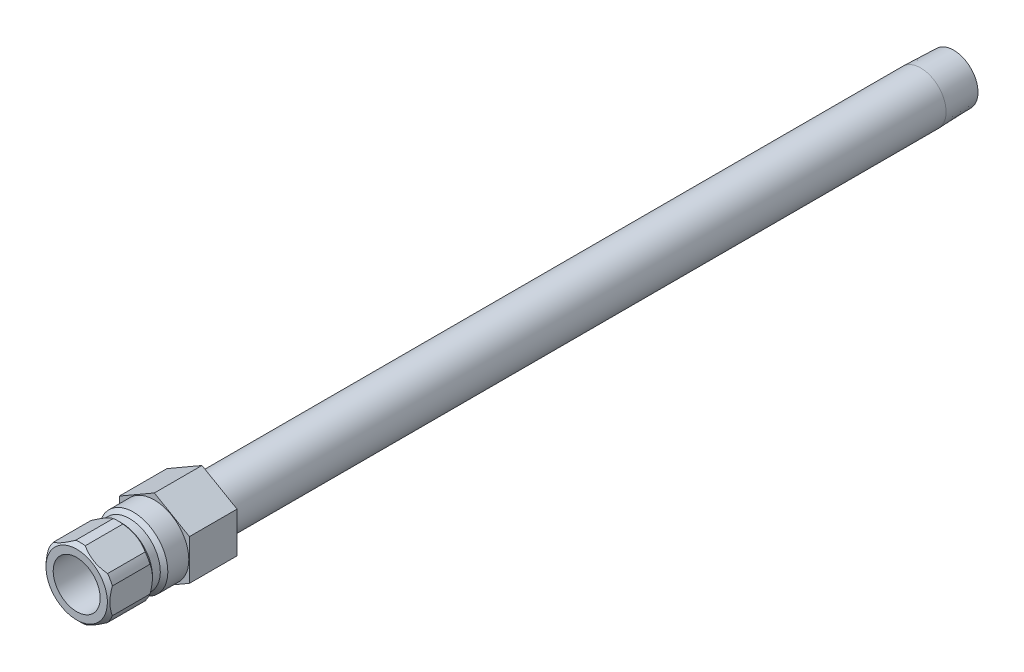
ISO-10303-21;
HEADER;
FILE_DESCRIPTION(('STEP AP214'),'2;1');
FILE_NAME('part.step','',(''),(''),'','','');
FILE_SCHEMA(('AUTOMOTIVE_DESIGN { 1 0 10303 214 1 1 1 1 }'));
ENDSEC;
DATA;
#1=APPLICATION_CONTEXT('core data for automotive mechanical design processes');
#2=APPLICATION_PROTOCOL_DEFINITION('international standard','automotive_design',2000,#1);
#3=PRODUCT_CONTEXT('',#1,'mechanical');
#4=PRODUCT('Part','Part','',(#3));
#5=PRODUCT_RELATED_PRODUCT_CATEGORY('part','',(#4));
#6=PRODUCT_DEFINITION_FORMATION('','',#4);
#7=PRODUCT_DEFINITION_CONTEXT('part definition',#1,'design');
#8=PRODUCT_DEFINITION('design','',#6,#7);
#9=PRODUCT_DEFINITION_SHAPE('','',#8);
#10=(LENGTH_UNIT() NAMED_UNIT(*) SI_UNIT(.MILLI.,.METRE.));
#11=(NAMED_UNIT(*) PLANE_ANGLE_UNIT() SI_UNIT($,.RADIAN.));
#12=(NAMED_UNIT(*) SI_UNIT($,.STERADIAN.) SOLID_ANGLE_UNIT());
#13=UNCERTAINTY_MEASURE_WITH_UNIT(LENGTH_MEASURE(1.E-05),#10,'distance_accuracy_value','');
#14=(GEOMETRIC_REPRESENTATION_CONTEXT(3) GLOBAL_UNCERTAINTY_ASSIGNED_CONTEXT((#13)) GLOBAL_UNIT_ASSIGNED_CONTEXT((#10,
#11,#12)) REPRESENTATION_CONTEXT('',''));
#15=CARTESIAN_POINT('',(0.,0.,0.));
#16=DIRECTION('',(0.,0.,1.));
#17=DIRECTION('',(1.,0.,0.));
#18=AXIS2_PLACEMENT_3D('',#15,#16,#17);
#19=CARTESIAN_POINT('',(0.,0.,-9.652));
#20=DIRECTION('',(0.,0.,-1.));
#21=DIRECTION('',(0.,1.,0.));
#22=AXIS2_PLACEMENT_3D('',#19,#20,#21);
#23=CYLINDRICAL_SURFACE('',#22,6.985);
#24=DIRECTION('',(0.,0.,-1.));
#25=VECTOR('',#24,1.);
#26=CARTESIAN_POINT('',(6.477,2.61509005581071,-9.652));
#27=LINE('',#26,#25);
#28=CARTESIAN_POINT('',(6.477,2.61509005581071,7.366));
#29=VERTEX_POINT('',#28);
#30=CARTESIAN_POINT('',(6.477,2.61509005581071,14.986));
#31=VERTEX_POINT('',#30);
#32=EDGE_CURVE('E372',#29,#31,#27,.F.);
#33=ORIENTED_EDGE('',*,*,#32,.F.);
#34=CARTESIAN_POINT('',(0.,0.,7.366));
#35=DIRECTION('',(0.,0.,-1.));
#36=DIRECTION('',(0.,1.,0.));
#37=AXIS2_PLACEMENT_3D('',#34,#35,#36);
#38=CIRCLE('',#37,6.985);
#39=CARTESIAN_POINT('',(5.50323442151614,4.30170151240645,7.366));
#40=VERTEX_POINT('',#39);
#41=EDGE_CURVE('E190',#40,#29,#38,.T.);
#42=ORIENTED_EDGE('',*,*,#41,.F.);
#43=DIRECTION('',(0.,0.,-1.));
#44=VECTOR('',#43,1.);
#45=CARTESIAN_POINT('',(5.50323442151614,4.30170151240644,-9.652));
#46=LINE('',#45,#44);
#47=CARTESIAN_POINT('',(5.50323442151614,4.30170151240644,14.986));
#48=VERTEX_POINT('',#47);
#49=EDGE_CURVE('E363',#48,#40,#46,.T.);
#50=ORIENTED_EDGE('',*,*,#49,.F.);
#51=CARTESIAN_POINT('',(0.,0.,14.986));
#52=DIRECTION('',(0.,0.,-1.));
#53=DIRECTION('',(0.,1.,0.));
#54=AXIS2_PLACEMENT_3D('',#51,#52,#53);
#55=CIRCLE('',#54,6.985);
#56=EDGE_CURVE('E205',#48,#31,#55,.T.);
#57=ORIENTED_EDGE('',*,*,#56,.T.);
#58=EDGE_LOOP('',(#33,#42,#50,#57));
#59=FACE_BOUND('',#58,.T.);
#60=ADVANCED_FACE('F34',(#59),#23,.T.);
#61=DIRECTION('',(0.,0.,-1.));
#62=VECTOR('',#61,1.);
#63=CARTESIAN_POINT('',(0.97376557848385,6.91679156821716,-9.652));
#64=LINE('',#63,#62);
#65=CARTESIAN_POINT('',(0.973765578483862,6.91679156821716,7.366));
#66=VERTEX_POINT('',#65);
#67=CARTESIAN_POINT('',(0.97376557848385,6.91679156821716,14.986));
#68=VERTEX_POINT('',#67);
#69=EDGE_CURVE('E283',#66,#68,#64,.F.);
#70=ORIENTED_EDGE('',*,*,#69,.F.);
#71=CARTESIAN_POINT('',(-0.973765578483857,6.91679156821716,7.366));
#72=VERTEX_POINT('',#71);
#73=EDGE_CURVE('E194',#72,#66,#38,.T.);
#74=ORIENTED_EDGE('',*,*,#73,.F.);
#75=DIRECTION('',(0.,0.,-1.));
#76=VECTOR('',#75,1.);
#77=CARTESIAN_POINT('',(-0.97376557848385,6.91679156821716,-9.652));
#78=LINE('',#77,#76);
#79=CARTESIAN_POINT('',(-0.97376557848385,6.91679156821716,14.986));
#80=VERTEX_POINT('',#79);
#81=EDGE_CURVE('E54',#80,#72,#78,.T.);
#82=ORIENTED_EDGE('',*,*,#81,.F.);
#83=EDGE_CURVE('E193',#80,#68,#55,.T.);
#84=ORIENTED_EDGE('',*,*,#83,.T.);
#85=EDGE_LOOP('',(#70,#74,#82,#84));
#86=FACE_BOUND('',#85,.T.);
#87=ADVANCED_FACE('F317',(#86),#23,.T.);
#88=DIRECTION('',(0.,0.,-1.));
#89=VECTOR('',#88,1.);
#90=CARTESIAN_POINT('',(-5.50323442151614,4.30170151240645,-9.652));
#91=LINE('',#90,#89);
#92=CARTESIAN_POINT('',(-5.50323442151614,4.30170151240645,7.366));
#93=VERTEX_POINT('',#92);
#94=CARTESIAN_POINT('',(-5.50323442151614,4.30170151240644,14.986));
#95=VERTEX_POINT('',#94);
#96=EDGE_CURVE('E361',#93,#95,#91,.F.);
#97=ORIENTED_EDGE('',*,*,#96,.F.);
#98=CARTESIAN_POINT('',(-6.477,2.6150900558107,7.366));
#99=VERTEX_POINT('',#98);
#100=EDGE_CURVE('E199',#99,#93,#38,.T.);
#101=ORIENTED_EDGE('',*,*,#100,.F.);
#102=DIRECTION('',(0.,0.,-1.));
#103=VECTOR('',#102,1.);
#104=CARTESIAN_POINT('',(-6.477,2.61509005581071,-9.652));
#105=LINE('',#104,#103);
#106=CARTESIAN_POINT('',(-6.477,2.6150900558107,14.986));
#107=VERTEX_POINT('',#106);
#108=EDGE_CURVE('E62',#107,#99,#105,.T.);
#109=ORIENTED_EDGE('',*,*,#108,.F.);
#110=EDGE_CURVE('E204',#107,#95,#55,.T.);
#111=ORIENTED_EDGE('',*,*,#110,.T.);
#112=EDGE_LOOP('',(#97,#101,#109,#111));
#113=FACE_BOUND('',#112,.T.);
#114=ADVANCED_FACE('F322',(#113),#23,.T.);
#115=DIRECTION('',(0.,0.,-1.));
#116=VECTOR('',#115,1.);
#117=CARTESIAN_POINT('',(-6.477,-2.61509005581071,-9.652));
#118=LINE('',#117,#116);
#119=CARTESIAN_POINT('',(-6.477,-2.61509005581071,7.366));
#120=VERTEX_POINT('',#119);
#121=CARTESIAN_POINT('',(-6.477,-2.61509005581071,14.986));
#122=VERTEX_POINT('',#121);
#123=EDGE_CURVE('E353',#120,#122,#118,.F.);
#124=ORIENTED_EDGE('',*,*,#123,.F.);
#125=CARTESIAN_POINT('',(-5.50323442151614,-4.30170151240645,7.366));
#126=VERTEX_POINT('',#125);
#127=EDGE_CURVE('E195',#126,#120,#38,.T.);
#128=ORIENTED_EDGE('',*,*,#127,.F.);
#129=DIRECTION('',(0.,0.,-1.));
#130=VECTOR('',#129,1.);
#131=CARTESIAN_POINT('',(-5.50323442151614,-4.30170151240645,-9.652));
#132=LINE('',#131,#130);
#133=CARTESIAN_POINT('',(-5.50323442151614,-4.30170151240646,14.986));
#134=VERTEX_POINT('',#133);
#135=EDGE_CURVE('E239',#134,#126,#132,.T.);
#136=ORIENTED_EDGE('',*,*,#135,.F.);
#137=EDGE_CURVE('E367',#134,#122,#55,.T.);
#138=ORIENTED_EDGE('',*,*,#137,.T.);
#139=EDGE_LOOP('',(#124,#128,#136,#138));
#140=FACE_BOUND('',#139,.T.);
#141=ADVANCED_FACE('F332',(#140),#23,.T.);
#142=DIRECTION('',(0.,0.,-1.));
#143=VECTOR('',#142,1.);
#144=CARTESIAN_POINT('',(-0.973765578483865,-6.91679156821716,-9.652));
#145=LINE('',#144,#143);
#146=CARTESIAN_POINT('',(-0.973765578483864,-6.91679156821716,7.366));
#147=VERTEX_POINT('',#146);
#148=CARTESIAN_POINT('',(-0.973765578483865,-6.91679156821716,14.986));
#149=VERTEX_POINT('',#148);
#150=EDGE_CURVE('E342',#147,#149,#145,.F.);
#151=ORIENTED_EDGE('',*,*,#150,.F.);
#152=CARTESIAN_POINT('',(0.973765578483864,-6.91679156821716,7.366));
#153=VERTEX_POINT('',#152);
#154=EDGE_CURVE('E191',#153,#147,#38,.T.);
#155=ORIENTED_EDGE('',*,*,#154,.F.);
#156=DIRECTION('',(0.,0.,-1.));
#157=VECTOR('',#156,1.);
#158=CARTESIAN_POINT('',(0.973765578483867,-6.91679156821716,-9.652));
#159=LINE('',#158,#157);
#160=CARTESIAN_POINT('',(0.973765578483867,-6.91679156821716,14.986));
#161=VERTEX_POINT('',#160);
#162=EDGE_CURVE('E168',#161,#153,#159,.T.);
#163=ORIENTED_EDGE('',*,*,#162,.F.);
#164=EDGE_CURVE('E344',#161,#149,#55,.T.);
#165=ORIENTED_EDGE('',*,*,#164,.T.);
#166=EDGE_LOOP('',(#151,#155,#163,#165));
#167=FACE_BOUND('',#166,.T.);
#168=ADVANCED_FACE('F326',(#167),#23,.T.);
#169=CARTESIAN_POINT('',(0.,0.,-9.652));
#170=DIRECTION('',(0.,0.,-1.));
#171=DIRECTION('',(0.,1.,0.));
#172=AXIS2_PLACEMENT_3D('',#169,#170,#171);
#173=CYLINDRICAL_SURFACE('',#172,4.7625);
#174=CARTESIAN_POINT('',(0.,0.,3.556));
#175=DIRECTION('',(0.,0.,-1.));
#176=DIRECTION('',(0.,1.,0.));
#177=AXIS2_PLACEMENT_3D('',#174,#175,#176);
#178=CIRCLE('',#177,4.7625);
#179=CARTESIAN_POINT('',(0.,4.7625,3.556));
#180=VERTEX_POINT('',#179);
#181=EDGE_CURVE('E420',#180,#180,#178,.T.);
#182=ORIENTED_EDGE('',*,*,#181,.T.);
#183=EDGE_LOOP('',(#182));
#184=FACE_BOUND('',#183,.T.);
#185=CARTESIAN_POINT('',(0.,0.,15.748));
#186=DIRECTION('',(0.,0.,-1.));
#187=DIRECTION('',(0.,1.,0.));
#188=AXIS2_PLACEMENT_3D('',#185,#186,#187);
#189=CIRCLE('',#188,4.7625);
#190=CARTESIAN_POINT('',(0.,4.7625,15.748));
#191=VERTEX_POINT('',#190);
#192=EDGE_CURVE('E209',#191,#191,#189,.T.);
#193=ORIENTED_EDGE('',*,*,#192,.F.);
#194=EDGE_LOOP('',(#193));
#195=FACE_BOUND('',#194,.T.);
#196=ADVANCED_FACE('F36',(#184,#195),#173,.F.);
#197=CARTESIAN_POINT('',(0.,4.7625,15.748));
#198=DIRECTION('',(0.,0.,1.));
#199=DIRECTION('',(0.,-1.,0.));
#200=AXIS2_PLACEMENT_3D('',#197,#198,#199);
#201=PLANE('',#200);
#202=ORIENTED_EDGE('',*,*,#192,.T.);
#203=EDGE_LOOP('',(#202));
#204=FACE_BOUND('',#203,.T.);
#205=CARTESIAN_POINT('',(0.,0.,15.748));
#206=DIRECTION('',(0.,0.,-1.));
#207=DIRECTION('',(0.,1.,0.));
#208=AXIS2_PLACEMENT_3D('',#205,#206,#207);
#209=CIRCLE('',#208,6.223);
#210=CARTESIAN_POINT('',(0.,6.223,15.748));
#211=VERTEX_POINT('',#210);
#212=EDGE_CURVE('E206',#211,#211,#209,.T.);
#213=ORIENTED_EDGE('',*,*,#212,.F.);
#214=EDGE_LOOP('',(#213));
#215=FACE_BOUND('',#214,.T.);
#216=ADVANCED_FACE('F245',(#204,#215),#201,.T.);
#217=CARTESIAN_POINT('',(0.,0.,14.986));
#218=DIRECTION('',(0.,0.,-1.));
#219=DIRECTION('',(0.,1.,0.));
#220=AXIS2_PLACEMENT_3D('',#217,#218,#219);
#221=CONICAL_SURFACE('',#220,6.985,0.785398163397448);
#222=CARTESIAN_POINT('',(6.477,-7.50531717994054,12.0573066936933));
#223=CARTESIAN_POINT('',(6.477,-7.32278230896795,12.1954662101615));
#224=CARTESIAN_POINT('',(6.477,-7.13923073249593,12.3323042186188));
#225=CARTESIAN_POINT('',(6.477,-6.76969107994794,12.6027438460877));
#226=CARTESIAN_POINT('',(6.477,-6.58370240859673,12.7363446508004));
#227=CARTESIAN_POINT('',(6.477,-6.20752484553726,13.0006667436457));
#228=CARTESIAN_POINT('',(6.477,-6.01731457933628,13.1313577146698));
#229=CARTESIAN_POINT('',(6.477,-5.63367369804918,13.3879087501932));
#230=CARTESIAN_POINT('',(6.477,-5.44024331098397,13.5137691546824));
#231=CARTESIAN_POINT('',(6.477,-5.03831720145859,13.7667102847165));
#232=CARTESIAN_POINT('',(6.477,-4.82959841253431,13.8934383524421));
#233=CARTESIAN_POINT('',(6.477,-4.4072839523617,14.1386241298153));
#234=CARTESIAN_POINT('',(6.477,-4.19368750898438,14.2570805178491));
#235=CARTESIAN_POINT('',(6.477,-3.76162676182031,14.4831715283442));
#236=CARTESIAN_POINT('',(6.477,-3.54317924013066,14.5908379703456));
#237=CARTESIAN_POINT('',(6.477,-3.10029556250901,14.7929384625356));
#238=CARTESIAN_POINT('',(6.477,-2.87586219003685,14.8873785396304));
#239=CARTESIAN_POINT('',(6.477,-2.43955826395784,15.0524966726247));
#240=CARTESIAN_POINT('',(6.477,-2.22819339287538,15.1244971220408));
#241=CARTESIAN_POINT('',(6.477,-1.80033354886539,15.2515475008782));
#242=CARTESIAN_POINT('',(6.477,-1.58383822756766,15.3065962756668));
#243=CARTESIAN_POINT('',(6.477,-1.1506339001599,15.3959385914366));
#244=CARTESIAN_POINT('',(6.477,-0.934000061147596,15.4305906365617));
#245=CARTESIAN_POINT('',(6.477,-0.498364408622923,15.4784594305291));
#246=CARTESIAN_POINT('',(6.477,-0.2793630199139,15.4916799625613));
#247=CARTESIAN_POINT('',(6.477,0.150697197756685,15.4956835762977));
#248=CARTESIAN_POINT('',(6.477,0.361748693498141,15.4872823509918));
#249=CARTESIAN_POINT('',(6.477,0.782066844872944,15.4503172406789));
#250=CARTESIAN_POINT('',(6.477,0.991333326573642,15.421751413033));
#251=CARTESIAN_POINT('',(6.477,1.41010575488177,15.3455375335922));
#252=CARTESIAN_POINT('',(6.477,1.6195513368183,15.2975631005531));
#253=CARTESIAN_POINT('',(6.477,2.03387291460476,15.1851046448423));
#254=CARTESIAN_POINT('',(6.477,2.23874927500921,15.1206219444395));
#255=CARTESIAN_POINT('',(6.477,2.66141718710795,14.9715598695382));
#256=CARTESIAN_POINT('',(6.477,2.87875617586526,14.8857103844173));
#257=CARTESIAN_POINT('',(6.477,3.30779766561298,14.7008180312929));
#258=CARTESIAN_POINT('',(6.477,3.51949749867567,14.6017690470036));
#259=CARTESIAN_POINT('',(6.477,3.93828980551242,14.3928329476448));
#260=CARTESIAN_POINT('',(6.477,4.14536521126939,14.282911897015));
#261=CARTESIAN_POINT('',(6.477,4.55475391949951,14.0546596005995));
#262=CARTESIAN_POINT('',(6.477,4.75706796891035,13.93632968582));
#263=CARTESIAN_POINT('',(6.477,5.14761370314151,13.6989609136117));
#264=CARTESIAN_POINT('',(6.477,5.33604552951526,13.580249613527));
#265=CARTESIAN_POINT('',(6.477,5.70967381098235,13.3378251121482));
#266=CARTESIAN_POINT('',(6.477,5.89487001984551,13.2141115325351));
#267=CARTESIAN_POINT('',(6.477,6.26095063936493,12.9635958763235));
#268=CARTESIAN_POINT('',(6.477,6.4418578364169,12.8368269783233));
#269=CARTESIAN_POINT('',(6.477,6.80119835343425,12.5799293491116));
#270=CARTESIAN_POINT('',(6.477,6.97963234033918,12.4498015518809));
#271=CARTESIAN_POINT('',(6.477,7.15703038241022,12.3183002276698));
#272=B_SPLINE_CURVE_WITH_KNOTS('',3,(#222,#223,#224,#225,#226,#227,#228,#229,#230,#231,#232,
#233,#234,#235,#236,#237,#238,#239,#240,#241,#242,#243,#244,#245,#246,#247,#248,#249,#250,#251,
#252,#253,#254,#255,#256,#257,#258,#259,#260,#261,#262,#263,#264,#265,#266,#267,#268,#269,#270,
#271),.UNSPECIFIED.,.F.,.F.,(4,2,2,2,2,2,2,2,2,2,2,2,2,2,2,2,2,2,2,2,2,2,2,2,4),(0.,
0.68679090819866,1.37375281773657,2.06603541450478,2.75826919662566,3.49065471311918,
4.22315698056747,4.95343127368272,5.68337170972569,6.35265989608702,7.02199365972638,
7.67918147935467,8.33625327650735,8.96890298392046,9.60161364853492,10.2454384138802,
10.8892116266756,11.5897073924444,12.2905288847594,12.9936114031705,13.696582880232,
14.3646145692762,15.0326968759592,15.6953618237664,16.3578444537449),.UNSPECIFIED.);
#273=CARTESIAN_POINT('',(6.477,-2.61509005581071,14.986));
#274=VERTEX_POINT('',#273);
#275=EDGE_CURVE('E375',#31,#274,#272,.F.);
#276=ORIENTED_EDGE('',*,*,#275,.F.);
#277=ORIENTED_EDGE('',*,*,#56,.F.);
#278=CARTESIAN_POINT('',(0.973302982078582,6.91705864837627,14.9858));
#279=CARTESIAN_POINT('',(1.1543052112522,6.81255696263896,15.0641166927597));
#280=CARTESIAN_POINT('',(1.3378209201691,6.70660411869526,15.1353544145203));
#281=CARTESIAN_POINT('',(1.70963160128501,6.49193912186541,15.2608524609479));
#282=CARTESIAN_POINT('',(1.89793754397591,6.38322063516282,15.3150691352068));
#283=CARTESIAN_POINT('',(2.27146153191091,6.16756646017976,15.401724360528));
#284=CARTESIAN_POINT('',(2.45655498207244,6.06070270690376,15.4348622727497));
#285=CARTESIAN_POINT('',(2.82844640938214,5.8459910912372,15.4802195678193));
#286=CARTESIAN_POINT('',(3.0152419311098,5.73814464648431,15.4924653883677));
#287=CARTESIAN_POINT('',(3.3948057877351,5.51900335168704,15.4953056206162));
#288=CARTESIAN_POINT('',(3.58757842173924,5.40770601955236,15.4852117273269));
#289=CARTESIAN_POINT('',(3.97148128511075,5.18605959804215,15.4426708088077));
#290=CARTESIAN_POINT('',(4.16260891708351,5.0757120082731,15.4101933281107));
#291=CARTESIAN_POINT('',(4.54854122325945,4.85289388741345,15.3234273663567));
#292=CARTESIAN_POINT('',(4.74321398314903,4.74049951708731,15.268364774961));
#293=CARTESIAN_POINT('',(5.03141021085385,4.5741093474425,15.1720079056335));
#294=CARTESIAN_POINT('',(5.12673323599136,4.51907457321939,15.1376422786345));
#295=CARTESIAN_POINT('',(5.31613879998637,4.40972121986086,15.0647445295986));
#296=CARTESIAN_POINT('',(5.41022179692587,4.35540237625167,15.0262139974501));
#297=CARTESIAN_POINT('',(5.50369701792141,4.30143443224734,14.9858));
#298=B_SPLINE_CURVE_WITH_KNOTS('',3,(#278,#279,#280,#281,#282,#283,#284,#285,#286,#287,#288,
#289,#290,#291,#292,#293,#294,#295,#296,#297),.UNSPECIFIED.,.F.,.F.,(4,2,2,2,2,2,2,2,2,4),(0.,
0.669810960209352,1.34132587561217,1.98920541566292,2.63626449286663,3.30353665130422,
3.97171850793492,4.66502165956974,5.01088265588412,5.35661208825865),.UNSPECIFIED.);
#299=EDGE_CURVE('E275',#68,#48,#298,.T.);
#300=ORIENTED_EDGE('',*,*,#299,.F.);
#301=ORIENTED_EDGE('',*,*,#83,.F.);
#302=CARTESIAN_POINT('',(-5.50369701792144,4.30143443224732,14.9858));
#303=CARTESIAN_POINT('',(-5.32269478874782,4.40593611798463,15.0641166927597));
#304=CARTESIAN_POINT('',(-5.13917907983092,4.51188896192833,15.1353544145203));
#305=CARTESIAN_POINT('',(-4.76736839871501,4.72655395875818,15.2608524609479));
#306=CARTESIAN_POINT('',(-4.57906245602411,4.83527244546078,15.3150691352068));
#307=CARTESIAN_POINT('',(-4.2055384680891,5.05092662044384,15.401724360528));
#308=CARTESIAN_POINT('',(-4.02044501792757,5.15779037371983,15.4348622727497));
#309=CARTESIAN_POINT('',(-3.64855359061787,5.3725019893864,15.4802195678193));
#310=CARTESIAN_POINT('',(-3.46175806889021,5.48034843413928,15.4924653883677));
#311=CARTESIAN_POINT('',(-3.0821942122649,5.69948972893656,15.4953056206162));
#312=CARTESIAN_POINT('',(-2.88942157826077,5.81078706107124,15.4852117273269));
#313=CARTESIAN_POINT('',(-2.50551871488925,6.03243348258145,15.4426708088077));
#314=CARTESIAN_POINT('',(-2.31439108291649,6.1427810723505,15.4101933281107));
#315=CARTESIAN_POINT('',(-1.92845877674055,6.36559919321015,15.3234273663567));
#316=CARTESIAN_POINT('',(-1.73378601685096,6.47799356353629,15.268364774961));
#317=CARTESIAN_POINT('',(-1.44558978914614,6.64438373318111,15.1720079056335));
#318=CARTESIAN_POINT('',(-1.35026676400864,6.69941850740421,15.1376422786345));
#319=CARTESIAN_POINT('',(-1.16086120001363,6.80877186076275,15.0647445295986));
#320=CARTESIAN_POINT('',(-1.06677820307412,6.86309070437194,15.0262139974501));
#321=CARTESIAN_POINT('',(-0.973302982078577,6.91705864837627,14.9858));
#322=B_SPLINE_CURVE_WITH_KNOTS('',3,(#302,#303,#304,#305,#306,#307,#308,#309,#310,#311,#312,
#313,#314,#315,#316,#317,#318,#319,#320,#321),.UNSPECIFIED.,.F.,.F.,(4,2,2,2,2,2,2,2,2,4),(0.,
0.669810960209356,1.34132587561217,1.98920541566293,2.63626449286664,3.30353665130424,
3.97171850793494,4.66502165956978,5.01088265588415,5.35661208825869),.UNSPECIFIED.);
#323=EDGE_CURVE('E267',#95,#80,#322,.T.);
#324=ORIENTED_EDGE('',*,*,#323,.F.);
#325=ORIENTED_EDGE('',*,*,#110,.F.);
#326=CARTESIAN_POINT('',(-6.477,-7.50531717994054,12.0573066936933));
#327=CARTESIAN_POINT('',(-6.477,-7.32278230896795,12.1954662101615));
#328=CARTESIAN_POINT('',(-6.477,-7.13923073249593,12.3323042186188));
#329=CARTESIAN_POINT('',(-6.477,-6.76969107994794,12.6027438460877));
#330=CARTESIAN_POINT('',(-6.477,-6.58370240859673,12.7363446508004));
#331=CARTESIAN_POINT('',(-6.477,-6.20752484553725,13.0006667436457));
#332=CARTESIAN_POINT('',(-6.477,-6.01731457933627,13.1313577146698));
#333=CARTESIAN_POINT('',(-6.477,-5.63367369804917,13.3879087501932));
#334=CARTESIAN_POINT('',(-6.477,-5.44024331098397,13.5137691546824));
#335=CARTESIAN_POINT('',(-6.477,-5.03831720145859,13.7667102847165));
#336=CARTESIAN_POINT('',(-6.477,-4.8295984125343,13.8934383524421));
#337=CARTESIAN_POINT('',(-6.477,-4.4072839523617,14.1386241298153));
#338=CARTESIAN_POINT('',(-6.477,-4.19368750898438,14.2570805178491));
#339=CARTESIAN_POINT('',(-6.477,-3.7616267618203,14.4831715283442));
#340=CARTESIAN_POINT('',(-6.477,-3.54317924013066,14.5908379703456));
#341=CARTESIAN_POINT('',(-6.477,-3.100295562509,14.7929384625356));
#342=CARTESIAN_POINT('',(-6.477,-2.87586219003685,14.8873785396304));
#343=CARTESIAN_POINT('',(-6.477,-2.43955826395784,15.0524966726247));
#344=CARTESIAN_POINT('',(-6.477,-2.22819339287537,15.1244971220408));
#345=CARTESIAN_POINT('',(-6.477,-1.80033354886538,15.2515475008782));
#346=CARTESIAN_POINT('',(-6.477,-1.58383822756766,15.3065962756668));
#347=CARTESIAN_POINT('',(-6.477,-1.15063390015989,15.3959385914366));
#348=CARTESIAN_POINT('',(-6.477,-0.934000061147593,15.4305906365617));
#349=CARTESIAN_POINT('',(-6.477,-0.498364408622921,15.4784594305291));
#350=CARTESIAN_POINT('',(-6.477,-0.279363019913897,15.4916799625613));
#351=CARTESIAN_POINT('',(-6.477,0.150697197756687,15.4956835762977));
#352=CARTESIAN_POINT('',(-6.477,0.361748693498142,15.4872823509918));
#353=CARTESIAN_POINT('',(-6.477,0.782066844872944,15.4503172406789));
#354=CARTESIAN_POINT('',(-6.477,0.991333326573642,15.421751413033));
#355=CARTESIAN_POINT('',(-6.477,1.41010575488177,15.3455375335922));
#356=CARTESIAN_POINT('',(-6.477,1.6195513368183,15.2975631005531));
#357=CARTESIAN_POINT('',(-6.477,2.03387291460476,15.1851046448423));
#358=CARTESIAN_POINT('',(-6.477,2.23874927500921,15.1206219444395));
#359=CARTESIAN_POINT('',(-6.477,2.66141718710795,14.9715598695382));
#360=CARTESIAN_POINT('',(-6.477,2.87875617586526,14.8857103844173));
#361=CARTESIAN_POINT('',(-6.477,3.30779766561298,14.7008180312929));
#362=CARTESIAN_POINT('',(-6.477,3.51949749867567,14.6017690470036));
#363=CARTESIAN_POINT('',(-6.477,3.93828980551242,14.3928329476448));
#364=CARTESIAN_POINT('',(-6.477,4.14536521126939,14.282911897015));
#365=CARTESIAN_POINT('',(-6.477,4.55475391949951,14.0546596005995));
#366=CARTESIAN_POINT('',(-6.477,4.75706796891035,13.93632968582));
#367=CARTESIAN_POINT('',(-6.477,5.14761370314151,13.6989609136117));
#368=CARTESIAN_POINT('',(-6.477,5.33604552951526,13.580249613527));
#369=CARTESIAN_POINT('',(-6.477,5.70967381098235,13.3378251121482));
#370=CARTESIAN_POINT('',(-6.477,5.89487001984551,13.2141115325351));
#371=CARTESIAN_POINT('',(-6.477,6.26095063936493,12.9635958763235));
#372=CARTESIAN_POINT('',(-6.477,6.4418578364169,12.8368269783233));
#373=CARTESIAN_POINT('',(-6.477,6.80119835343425,12.5799293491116));
#374=CARTESIAN_POINT('',(-6.477,6.97963234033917,12.4498015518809));
#375=CARTESIAN_POINT('',(-6.477,7.15703038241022,12.3183002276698));
#376=B_SPLINE_CURVE_WITH_KNOTS('',3,(#326,#327,#328,#329,#330,#331,#332,#333,#334,#335,#336,
#337,#338,#339,#340,#341,#342,#343,#344,#345,#346,#347,#348,#349,#350,#351,#352,#353,#354,#355,
#356,#357,#358,#359,#360,#361,#362,#363,#364,#365,#366,#367,#368,#369,#370,#371,#372,#373,#374,
#375),.UNSPECIFIED.,.F.,.F.,(4,2,2,2,2,2,2,2,2,2,2,2,2,2,2,2,2,2,2,2,2,2,2,2,4),(0.,
0.686790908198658,1.37375281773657,2.06603541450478,2.75826919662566,3.49065471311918,
4.22315698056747,4.95343127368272,5.68337170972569,6.35265989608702,7.02199365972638,
7.67918147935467,8.33625327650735,8.96890298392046,9.60161364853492,10.2454384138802,
10.8892116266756,11.5897073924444,12.2905288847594,12.9936114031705,13.696582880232,
14.3646145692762,15.0326968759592,15.6953618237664,16.3578444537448),.UNSPECIFIED.);
#377=EDGE_CURVE('E260',#122,#107,#376,.T.);
#378=ORIENTED_EDGE('',*,*,#377,.F.);
#379=ORIENTED_EDGE('',*,*,#137,.F.);
#380=CARTESIAN_POINT('',(-0.973302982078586,-6.91705864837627,14.9858));
#381=CARTESIAN_POINT('',(-1.1543052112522,-6.81255696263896,15.0641166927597));
#382=CARTESIAN_POINT('',(-1.3378209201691,-6.70660411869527,15.1353544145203));
#383=CARTESIAN_POINT('',(-1.70963160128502,-6.49193912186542,15.2608524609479));
#384=CARTESIAN_POINT('',(-1.89793754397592,-6.38322063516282,15.3150691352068));
#385=CARTESIAN_POINT('',(-2.27146153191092,-6.16756646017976,15.401724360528));
#386=CARTESIAN_POINT('',(-2.45655498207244,-6.06070270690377,15.4348622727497));
#387=CARTESIAN_POINT('',(-2.82844640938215,-5.8459910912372,15.4802195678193));
#388=CARTESIAN_POINT('',(-3.0152419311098,-5.73814464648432,15.4924653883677));
#389=CARTESIAN_POINT('',(-3.39480578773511,-5.51900335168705,15.4953056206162));
#390=CARTESIAN_POINT('',(-3.58757842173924,-5.40770601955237,15.4852117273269));
#391=CARTESIAN_POINT('',(-3.97148128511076,-5.18605959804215,15.4426708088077));
#392=CARTESIAN_POINT('',(-4.16260891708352,-5.0757120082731,15.4101933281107));
#393=CARTESIAN_POINT('',(-4.54854122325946,-4.85289388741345,15.3234273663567));
#394=CARTESIAN_POINT('',(-4.74321398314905,-4.74049951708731,15.268364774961));
#395=CARTESIAN_POINT('',(-5.03141021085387,-4.57410934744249,15.1720079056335));
#396=CARTESIAN_POINT('',(-5.12673323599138,-4.51907457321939,15.1376422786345));
#397=CARTESIAN_POINT('',(-5.31613879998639,-4.40972121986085,15.0647445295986));
#398=CARTESIAN_POINT('',(-5.4102217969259,-4.35540237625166,15.0262139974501));
#399=CARTESIAN_POINT('',(-5.50369701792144,-4.30143443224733,14.9858));
#400=B_SPLINE_CURVE_WITH_KNOTS('',3,(#380,#381,#382,#383,#384,#385,#386,#387,#388,#389,#390,
#391,#392,#393,#394,#395,#396,#397,#398,#399),.UNSPECIFIED.,.F.,.F.,(4,2,2,2,2,2,2,2,2,4),(0.,
0.669810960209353,1.34132587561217,1.98920541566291,2.63626449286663,3.30353665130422,
3.97171850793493,4.66502165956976,5.01088265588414,5.35661208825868),.UNSPECIFIED.);
#401=EDGE_CURVE('E253',#149,#134,#400,.T.);
#402=ORIENTED_EDGE('',*,*,#401,.F.);
#403=ORIENTED_EDGE('',*,*,#164,.F.);
#404=CARTESIAN_POINT('',(5.50369701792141,-4.30143443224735,14.9858));
#405=CARTESIAN_POINT('',(5.32269478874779,-4.40593611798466,15.0641166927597));
#406=CARTESIAN_POINT('',(5.13917907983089,-4.51188896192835,15.1353544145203));
#407=CARTESIAN_POINT('',(4.76736839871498,-4.7265539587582,15.2608524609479));
#408=CARTESIAN_POINT('',(4.57906245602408,-4.8352724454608,15.3150691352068));
#409=CARTESIAN_POINT('',(4.20553846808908,-5.05092662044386,15.401724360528));
#410=CARTESIAN_POINT('',(4.02044501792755,-5.15779037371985,15.4348622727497));
#411=CARTESIAN_POINT('',(3.64855359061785,-5.37250198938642,15.4802195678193));
#412=CARTESIAN_POINT('',(3.46175806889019,-5.4803484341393,15.4924653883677));
#413=CARTESIAN_POINT('',(3.08219421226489,-5.69948972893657,15.4953056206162));
#414=CARTESIAN_POINT('',(2.88942157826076,-5.81078706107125,15.4852117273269));
#415=CARTESIAN_POINT('',(2.50551871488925,-6.03243348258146,15.4426708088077));
#416=CARTESIAN_POINT('',(2.31439108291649,-6.14278107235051,15.4101933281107));
#417=CARTESIAN_POINT('',(1.92845877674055,-6.36559919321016,15.3234273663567));
#418=CARTESIAN_POINT('',(1.73378601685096,-6.4779935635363,15.268364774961));
#419=CARTESIAN_POINT('',(1.44558978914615,-6.64438373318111,15.1720079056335));
#420=CARTESIAN_POINT('',(1.35026676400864,-6.69941850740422,15.1376422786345));
#421=CARTESIAN_POINT('',(1.16086120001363,-6.80877186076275,15.0647445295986));
#422=CARTESIAN_POINT('',(1.06677820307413,-6.86309070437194,15.0262139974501));
#423=CARTESIAN_POINT('',(0.973302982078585,-6.91705864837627,14.9858));
#424=B_SPLINE_CURVE_WITH_KNOTS('',3,(#404,#405,#406,#407,#408,#409,#410,#411,#412,#413,#414,
#415,#416,#417,#418,#419,#420,#421,#422,#423),.UNSPECIFIED.,.F.,.F.,(4,2,2,2,2,2,2,2,2,4),(0.,
0.669810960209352,1.34132587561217,1.98920541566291,2.63626449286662,3.30353665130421,
3.9717185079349,4.66502165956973,5.0108826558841,5.35661208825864),.UNSPECIFIED.);
#425=CARTESIAN_POINT('',(5.50323442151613,-4.30170151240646,14.986));
#426=VERTEX_POINT('',#425);
#427=EDGE_CURVE('E184',#426,#161,#424,.T.);
#428=ORIENTED_EDGE('',*,*,#427,.F.);
#429=EDGE_CURVE('E183',#274,#426,#55,.T.);
#430=ORIENTED_EDGE('',*,*,#429,.F.);
#431=EDGE_LOOP('',(#276,#277,#300,#301,#324,#325,#378,#379,#402,#403,#428,#430));
#432=FACE_BOUND('',#431,.T.);
#433=ORIENTED_EDGE('',*,*,#212,.T.);
#434=EDGE_LOOP('',(#433));
#435=FACE_BOUND('',#434,.T.);
#436=ADVANCED_FACE('F242',(#432,#435),#221,.T.);
#437=DIRECTION('',(0.,0.,-1.));
#438=VECTOR('',#437,1.);
#439=CARTESIAN_POINT('',(6.477,-2.61509005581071,-9.652));
#440=LINE('',#439,#438);
#441=CARTESIAN_POINT('',(6.477,-2.61509005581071,7.366));
#442=VERTEX_POINT('',#441);
#443=EDGE_CURVE('E282',#274,#442,#440,.T.);
#444=ORIENTED_EDGE('',*,*,#443,.F.);
#445=ORIENTED_EDGE('',*,*,#429,.T.);
#446=DIRECTION('',(0.,0.,-1.));
#447=VECTOR('',#446,1.);
#448=CARTESIAN_POINT('',(5.50323442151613,-4.30170151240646,-9.652));
#449=LINE('',#448,#447);
#450=CARTESIAN_POINT('',(5.50323442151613,-4.30170151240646,7.366));
#451=VERTEX_POINT('',#450);
#452=EDGE_CURVE('E165',#451,#426,#449,.F.);
#453=ORIENTED_EDGE('',*,*,#452,.F.);
#454=EDGE_CURVE('E181',#442,#451,#38,.T.);
#455=ORIENTED_EDGE('',*,*,#454,.F.);
#456=EDGE_LOOP('',(#444,#445,#453,#455));
#457=FACE_BOUND('',#456,.T.);
#458=ADVANCED_FACE('F180',(#457),#23,.T.);
#459=CARTESIAN_POINT('',(0.,0.,6.604));
#460=DIRECTION('',(0.,0.,1.));
#461=DIRECTION('',(0.,-1.,0.));
#462=AXIS2_PLACEMENT_3D('',#459,#460,#461);
#463=CONICAL_SURFACE('',#462,6.223,0.785398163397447);
#464=CARTESIAN_POINT('',(6.477,-7.50531717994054,10.2946933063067));
#465=CARTESIAN_POINT('',(6.477,-7.32278230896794,10.1565337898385));
#466=CARTESIAN_POINT('',(6.477,-7.13923073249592,10.0196957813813));
#467=CARTESIAN_POINT('',(6.477,-6.76969107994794,9.74925615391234));
#468=CARTESIAN_POINT('',(6.477,-6.58370240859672,9.61565534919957));
#469=CARTESIAN_POINT('',(6.477,-6.20752484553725,9.35133325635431));
#470=CARTESIAN_POINT('',(6.477,-6.01731457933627,9.22064228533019));
#471=CARTESIAN_POINT('',(6.477,-5.63367369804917,8.96409124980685));
#472=CARTESIAN_POINT('',(6.477,-5.44024331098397,8.83823084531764));
#473=CARTESIAN_POINT('',(6.477,-5.03831720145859,8.58528971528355));
#474=CARTESIAN_POINT('',(6.477,-4.82959841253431,8.45856164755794));
#475=CARTESIAN_POINT('',(6.477,-4.4072839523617,8.21337587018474));
#476=CARTESIAN_POINT('',(6.477,-4.19368750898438,8.09491948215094));
#477=CARTESIAN_POINT('',(6.477,-3.76162676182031,7.8688284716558));
#478=CARTESIAN_POINT('',(6.477,-3.54317924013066,7.76116202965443));
#479=CARTESIAN_POINT('',(6.477,-3.10029556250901,7.55906153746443));
#480=CARTESIAN_POINT('',(6.477,-2.87586219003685,7.46462146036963));
#481=CARTESIAN_POINT('',(6.477,-2.43955826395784,7.2995033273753));
#482=CARTESIAN_POINT('',(6.477,-2.22819339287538,7.2275028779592));
#483=CARTESIAN_POINT('',(6.477,-1.80033354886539,7.10045249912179));
#484=CARTESIAN_POINT('',(6.477,-1.58383822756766,7.0454037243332));
#485=CARTESIAN_POINT('',(6.477,-1.1506339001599,6.95606140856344));
#486=CARTESIAN_POINT('',(6.477,-0.934000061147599,6.92140936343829));
#487=CARTESIAN_POINT('',(6.477,-0.498364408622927,6.87354056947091));
#488=CARTESIAN_POINT('',(6.477,-0.279363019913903,6.86032003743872));
#489=CARTESIAN_POINT('',(6.477,0.15069719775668,6.85631642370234));
#490=CARTESIAN_POINT('',(6.477,0.361748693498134,6.8647176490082));
#491=CARTESIAN_POINT('',(6.477,0.782066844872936,6.90168275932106));
#492=CARTESIAN_POINT('',(6.477,0.991333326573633,6.93024858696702));
#493=CARTESIAN_POINT('',(6.477,1.41010575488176,7.00646246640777));
#494=CARTESIAN_POINT('',(6.477,1.61955133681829,7.05443689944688));
#495=CARTESIAN_POINT('',(6.477,2.03387291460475,7.16689535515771));
#496=CARTESIAN_POINT('',(6.477,2.2387492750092,7.23137805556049));
#497=CARTESIAN_POINT('',(6.477,2.66141718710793,7.38044013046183));
#498=CARTESIAN_POINT('',(6.477,2.87875617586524,7.46628961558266));
#499=CARTESIAN_POINT('',(6.477,3.30779766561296,7.65118196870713));
#500=CARTESIAN_POINT('',(6.477,3.51949749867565,7.75023095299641));
#501=CARTESIAN_POINT('',(6.477,3.93828980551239,7.95916705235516));
#502=CARTESIAN_POINT('',(6.477,4.14536521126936,8.069088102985));
#503=CARTESIAN_POINT('',(6.477,4.55475391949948,8.29734039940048));
#504=CARTESIAN_POINT('',(6.477,4.75706796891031,8.41567031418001));
#505=CARTESIAN_POINT('',(6.477,5.14761370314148,8.65303908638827));
#506=CARTESIAN_POINT('',(6.477,5.33604552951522,8.77175038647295));
#507=CARTESIAN_POINT('',(6.477,5.70967381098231,9.01417488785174));
#508=CARTESIAN_POINT('',(6.477,5.89487001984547,9.13788846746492));
#509=CARTESIAN_POINT('',(6.477,6.26095063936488,9.38840412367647));
#510=CARTESIAN_POINT('',(6.477,6.44185783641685,9.5151730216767));
#511=CARTESIAN_POINT('',(6.477,6.8011983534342,9.77207065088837));
#512=CARTESIAN_POINT('',(6.477,6.97963234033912,9.90219844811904));
#513=CARTESIAN_POINT('',(6.477,7.15703038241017,10.0336997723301));
#514=B_SPLINE_CURVE_WITH_KNOTS('',3,(#464,#465,#466,#467,#468,#469,#470,#471,#472,#473,#474,
#475,#476,#477,#478,#479,#480,#481,#482,#483,#484,#485,#486,#487,#488,#489,#490,#491,#492,#493,
#494,#495,#496,#497,#498,#499,#500,#501,#502,#503,#504,#505,#506,#507,#508,#509,#510,#511,#512,
#513),.UNSPECIFIED.,.F.,.F.,(4,2,2,2,2,2,2,2,2,2,2,2,2,2,2,2,2,2,2,2,2,2,2,2,4),(0.,
0.686790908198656,1.37375281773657,2.06603541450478,2.75826919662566,3.49065471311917,
4.22315698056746,4.95343127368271,5.68337170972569,6.35265989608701,7.02199365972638,
7.67918147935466,8.33625327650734,8.96890298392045,9.6016136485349,10.2454384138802,
10.8892116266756,11.5897073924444,12.2905288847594,12.9936114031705,13.6965828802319,
14.3646145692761,15.0326968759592,15.6953618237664,16.3578444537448),.UNSPECIFIED.);
#515=EDGE_CURVE('E12',#442,#29,#514,.T.);
#516=ORIENTED_EDGE('',*,*,#515,.F.);
#517=ORIENTED_EDGE('',*,*,#454,.T.);
#518=CARTESIAN_POINT('',(0.973302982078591,-6.91705864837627,7.3662));
#519=CARTESIAN_POINT('',(1.15430521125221,-6.81255696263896,7.28788330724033));
#520=CARTESIAN_POINT('',(1.33782092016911,-6.70660411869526,7.21664558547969));
#521=CARTESIAN_POINT('',(1.70963160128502,-6.49193912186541,7.09114753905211));
#522=CARTESIAN_POINT('',(1.89793754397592,-6.38322063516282,7.03693086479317));
#523=CARTESIAN_POINT('',(2.27146153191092,-6.16756646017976,6.95027563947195));
#524=CARTESIAN_POINT('',(2.45655498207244,-6.06070270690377,6.91713772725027));
#525=CARTESIAN_POINT('',(2.82844640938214,-5.8459910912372,6.87178043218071));
#526=CARTESIAN_POINT('',(3.0152419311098,-5.73814464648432,6.85953461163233));
#527=CARTESIAN_POINT('',(3.3948057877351,-5.51900335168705,6.85669437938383));
#528=CARTESIAN_POINT('',(3.58757842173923,-5.40770601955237,6.86678827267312));
#529=CARTESIAN_POINT('',(3.97148128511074,-5.18605959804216,6.90932919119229));
#530=CARTESIAN_POINT('',(4.1626089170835,-5.07571200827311,6.94180667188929));
#531=CARTESIAN_POINT('',(4.54854122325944,-4.85289388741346,7.02857263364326));
#532=CARTESIAN_POINT('',(4.74321398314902,-4.74049951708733,7.08363522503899));
#533=CARTESIAN_POINT('',(5.03141021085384,-4.57410934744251,7.17999209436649));
#534=CARTESIAN_POINT('',(5.12673323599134,-4.51907457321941,7.21435772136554));
#535=CARTESIAN_POINT('',(5.31613879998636,-4.40972121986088,7.28725547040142));
#536=CARTESIAN_POINT('',(5.41022179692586,-4.35540237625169,7.32578600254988));
#537=CARTESIAN_POINT('',(5.5036970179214,-4.30143443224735,7.3662));
#538=B_SPLINE_CURVE_WITH_KNOTS('',3,(#518,#519,#520,#521,#522,#523,#524,#525,#526,#527,#528,
#529,#530,#531,#532,#533,#534,#535,#536,#537),.UNSPECIFIED.,.F.,.F.,(4,2,2,2,2,2,2,2,2,4),(0.,
0.669810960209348,1.34132587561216,1.98920541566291,2.63626449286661,3.3035366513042,
3.97171850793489,4.66502165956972,5.01088265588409,5.35661208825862),.UNSPECIFIED.);
#539=EDGE_CURVE('E162',#153,#451,#538,.T.);
#540=ORIENTED_EDGE('',*,*,#539,.F.);
#541=ORIENTED_EDGE('',*,*,#154,.T.);
#542=CARTESIAN_POINT('',(-5.50369701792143,-4.30143443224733,7.36620000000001));
#543=CARTESIAN_POINT('',(-5.32269478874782,-4.40593611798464,7.28788330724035));
#544=CARTESIAN_POINT('',(-5.13917907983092,-4.51188896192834,7.2166455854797));
#545=CARTESIAN_POINT('',(-4.767368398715,-4.72655395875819,7.09114753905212));
#546=CARTESIAN_POINT('',(-4.5790624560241,-4.83527244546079,7.03693086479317));
#547=CARTESIAN_POINT('',(-4.2055384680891,-5.05092662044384,6.95027563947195));
#548=CARTESIAN_POINT('',(-4.02044501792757,-5.15779037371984,6.91713772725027));
#549=CARTESIAN_POINT('',(-3.64855359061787,-5.37250198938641,6.87178043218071));
#550=CARTESIAN_POINT('',(-3.46175806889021,-5.48034843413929,6.85953461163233));
#551=CARTESIAN_POINT('',(-3.08219421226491,-5.69948972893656,6.85669437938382));
#552=CARTESIAN_POINT('',(-2.88942157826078,-5.81078706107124,6.86678827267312));
#553=CARTESIAN_POINT('',(-2.50551871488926,-6.03243348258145,6.90932919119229));
#554=CARTESIAN_POINT('',(-2.3143910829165,-6.1427810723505,6.94180667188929));
#555=CARTESIAN_POINT('',(-1.92845877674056,-6.36559919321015,7.02857263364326));
#556=CARTESIAN_POINT('',(-1.73378601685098,-6.47799356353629,7.08363522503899));
#557=CARTESIAN_POINT('',(-1.44558978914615,-6.6443837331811,7.17999209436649));
#558=CARTESIAN_POINT('',(-1.35026676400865,-6.69941850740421,7.21435772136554));
#559=CARTESIAN_POINT('',(-1.16086120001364,-6.80877186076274,7.28725547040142));
#560=CARTESIAN_POINT('',(-1.06677820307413,-6.86309070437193,7.32578600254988));
#561=CARTESIAN_POINT('',(-0.973302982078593,-6.91705864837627,7.3662));
#562=B_SPLINE_CURVE_WITH_KNOTS('',3,(#542,#543,#544,#545,#546,#547,#548,#549,#550,#551,#552,
#553,#554,#555,#556,#557,#558,#559,#560,#561),.UNSPECIFIED.,.F.,.F.,(4,2,2,2,2,2,2,2,2,4),(0.,
0.669810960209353,1.34132587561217,1.98920541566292,2.63626449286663,3.30353665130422,
3.97171850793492,4.66502165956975,5.01088265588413,5.35661208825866),.UNSPECIFIED.);
#563=EDGE_CURVE('E173',#126,#147,#562,.T.);
#564=ORIENTED_EDGE('',*,*,#563,.F.);
#565=ORIENTED_EDGE('',*,*,#127,.T.);
#566=CARTESIAN_POINT('',(-6.477,-7.50531717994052,10.2946933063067));
#567=CARTESIAN_POINT('',(-6.477,-7.32278230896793,10.1565337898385));
#568=CARTESIAN_POINT('',(-6.477,-7.13923073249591,10.0196957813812));
#569=CARTESIAN_POINT('',(-6.477,-6.76969107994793,9.74925615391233));
#570=CARTESIAN_POINT('',(-6.477,-6.58370240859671,9.61565534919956));
#571=CARTESIAN_POINT('',(-6.477,-6.20752484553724,9.35133325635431));
#572=CARTESIAN_POINT('',(-6.477,-6.01731457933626,9.22064228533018));
#573=CARTESIAN_POINT('',(-6.477,-5.63367369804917,8.96409124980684));
#574=CARTESIAN_POINT('',(-6.477,-5.44024331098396,8.83823084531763));
#575=CARTESIAN_POINT('',(-6.477,-5.03831720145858,8.58528971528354));
#576=CARTESIAN_POINT('',(-6.477,-4.8295984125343,8.45856164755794));
#577=CARTESIAN_POINT('',(-6.477,-4.4072839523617,8.21337587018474));
#578=CARTESIAN_POINT('',(-6.477,-4.19368750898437,8.09491948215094));
#579=CARTESIAN_POINT('',(-6.477,-3.7616267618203,7.8688284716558));
#580=CARTESIAN_POINT('',(-6.477,-3.54317924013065,7.76116202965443));
#581=CARTESIAN_POINT('',(-6.477,-3.100295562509,7.55906153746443));
#582=CARTESIAN_POINT('',(-6.477,-2.87586219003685,7.46462146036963));
#583=CARTESIAN_POINT('',(-6.477,-2.43955826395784,7.2995033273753));
#584=CARTESIAN_POINT('',(-6.477,-2.22819339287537,7.2275028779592));
#585=CARTESIAN_POINT('',(-6.477,-1.80033354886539,7.10045249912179));
#586=CARTESIAN_POINT('',(-6.477,-1.58383822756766,7.0454037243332));
#587=CARTESIAN_POINT('',(-6.477,-1.1506339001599,6.95606140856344));
#588=CARTESIAN_POINT('',(-6.477,-0.934000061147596,6.92140936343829));
#589=CARTESIAN_POINT('',(-6.477,-0.498364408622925,6.87354056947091));
#590=CARTESIAN_POINT('',(-6.477,-0.279363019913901,6.86032003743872));
#591=CARTESIAN_POINT('',(-6.477,0.150697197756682,6.85631642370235));
#592=CARTESIAN_POINT('',(-6.477,0.361748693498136,6.8647176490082));
#593=CARTESIAN_POINT('',(-6.477,0.782066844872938,6.90168275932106));
#594=CARTESIAN_POINT('',(-6.477,0.991333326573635,6.93024858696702));
#595=CARTESIAN_POINT('',(-6.477,1.41010575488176,7.00646246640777));
#596=CARTESIAN_POINT('',(-6.477,1.6195513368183,7.05443689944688));
#597=CARTESIAN_POINT('',(-6.477,2.03387291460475,7.16689535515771));
#598=CARTESIAN_POINT('',(-6.477,2.2387492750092,7.23137805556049));
#599=CARTESIAN_POINT('',(-6.477,2.66141718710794,7.38044013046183));
#600=CARTESIAN_POINT('',(-6.477,2.87875617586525,7.46628961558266));
#601=CARTESIAN_POINT('',(-6.477,3.30779766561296,7.65118196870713));
#602=CARTESIAN_POINT('',(-6.477,3.51949749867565,7.75023095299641));
#603=CARTESIAN_POINT('',(-6.477,3.9382898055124,7.95916705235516));
#604=CARTESIAN_POINT('',(-6.477,4.14536521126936,8.069088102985));
#605=CARTESIAN_POINT('',(-6.477,4.55475391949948,8.29734039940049));
#606=CARTESIAN_POINT('',(-6.477,4.75706796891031,8.41567031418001));
#607=CARTESIAN_POINT('',(-6.477,5.14761370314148,8.65303908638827));
#608=CARTESIAN_POINT('',(-6.477,5.33604552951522,8.77175038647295));
#609=CARTESIAN_POINT('',(-6.477,5.70967381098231,9.01417488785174));
#610=CARTESIAN_POINT('',(-6.477,5.89487001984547,9.13788846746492));
#611=CARTESIAN_POINT('',(-6.477,6.26095063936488,9.38840412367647));
#612=CARTESIAN_POINT('',(-6.477,6.44185783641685,9.5151730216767));
#613=CARTESIAN_POINT('',(-6.477,6.8011983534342,9.77207065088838));
#614=CARTESIAN_POINT('',(-6.477,6.97963234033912,9.90219844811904));
#615=CARTESIAN_POINT('',(-6.477,7.15703038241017,10.0336997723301));
#616=B_SPLINE_CURVE_WITH_KNOTS('',3,(#566,#567,#568,#569,#570,#571,#572,#573,#574,#575,#576,
#577,#578,#579,#580,#581,#582,#583,#584,#585,#586,#587,#588,#589,#590,#591,#592,#593,#594,#595,
#596,#597,#598,#599,#600,#601,#602,#603,#604,#605,#606,#607,#608,#609,#610,#611,#612,#613,#614,
#615),.UNSPECIFIED.,.F.,.F.,(4,2,2,2,2,2,2,2,2,2,2,2,2,2,2,2,2,2,2,2,2,2,2,2,4),(0.,
0.686790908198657,1.37375281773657,2.06603541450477,2.75826919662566,3.49065471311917,
4.22315698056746,4.95343127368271,5.68337170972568,6.352659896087,7.02199365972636,
7.67918147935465,8.33625327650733,8.96890298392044,9.60161364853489,10.2454384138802,
10.8892116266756,11.5897073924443,12.2905288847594,12.9936114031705,13.6965828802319,
14.3646145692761,15.0326968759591,15.6953618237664,16.3578444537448),.UNSPECIFIED.);
#617=EDGE_CURVE('E303',#99,#120,#616,.F.);
#618=ORIENTED_EDGE('',*,*,#617,.F.);
#619=ORIENTED_EDGE('',*,*,#100,.T.);
#620=CARTESIAN_POINT('',(-0.973302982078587,6.91705864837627,7.3662));
#621=CARTESIAN_POINT('',(-1.1543052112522,6.81255696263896,7.28788330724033));
#622=CARTESIAN_POINT('',(-1.3378209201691,6.70660411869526,7.21664558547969));
#623=CARTESIAN_POINT('',(-1.70963160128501,6.49193912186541,7.09114753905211));
#624=CARTESIAN_POINT('',(-1.89793754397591,6.38322063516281,7.03693086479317));
#625=CARTESIAN_POINT('',(-2.27146153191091,6.16756646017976,6.95027563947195));
#626=CARTESIAN_POINT('',(-2.45655498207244,6.06070270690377,6.91713772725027));
#627=CARTESIAN_POINT('',(-2.82844640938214,5.8459910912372,6.87178043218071));
#628=CARTESIAN_POINT('',(-3.0152419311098,5.73814464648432,6.85953461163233));
#629=CARTESIAN_POINT('',(-3.3948057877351,5.51900335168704,6.85669437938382));
#630=CARTESIAN_POINT('',(-3.58757842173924,5.40770601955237,6.86678827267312));
#631=CARTESIAN_POINT('',(-3.97148128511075,5.18605959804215,6.90932919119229));
#632=CARTESIAN_POINT('',(-4.16260891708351,5.0757120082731,6.94180667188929));
#633=CARTESIAN_POINT('',(-4.54854122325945,4.85289388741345,7.02857263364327));
#634=CARTESIAN_POINT('',(-4.74321398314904,4.74049951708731,7.08363522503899));
#635=CARTESIAN_POINT('',(-5.03141021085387,4.57410934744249,7.1799920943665));
#636=CARTESIAN_POINT('',(-5.12673323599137,4.51907457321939,7.21435772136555));
#637=CARTESIAN_POINT('',(-5.31613879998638,4.40972121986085,7.28725547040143));
#638=CARTESIAN_POINT('',(-5.41022179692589,4.35540237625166,7.32578600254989));
#639=CARTESIAN_POINT('',(-5.50369701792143,4.30143443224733,7.36620000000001));
#640=B_SPLINE_CURVE_WITH_KNOTS('',3,(#620,#621,#622,#623,#624,#625,#626,#627,#628,#629,#630,
#631,#632,#633,#634,#635,#636,#637,#638,#639),.UNSPECIFIED.,.F.,.F.,(4,2,2,2,2,2,2,2,2,4),(0.,
0.669810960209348,1.34132587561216,1.98920541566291,2.63626449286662,3.30353665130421,
3.97171850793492,4.66502165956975,5.01088265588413,5.35661208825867),.UNSPECIFIED.);
#641=EDGE_CURVE('E299',#72,#93,#640,.T.);
#642=ORIENTED_EDGE('',*,*,#641,.F.);
#643=ORIENTED_EDGE('',*,*,#73,.T.);
#644=CARTESIAN_POINT('',(5.5036970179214,4.30143443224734,7.3662));
#645=CARTESIAN_POINT('',(5.32269478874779,4.40593611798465,7.28788330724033));
#646=CARTESIAN_POINT('',(5.13917907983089,4.51188896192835,7.21664558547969));
#647=CARTESIAN_POINT('',(4.76736839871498,4.7265539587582,7.09114753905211));
#648=CARTESIAN_POINT('',(4.57906245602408,4.83527244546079,7.03693086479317));
#649=CARTESIAN_POINT('',(4.20553846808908,5.05092662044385,6.95027563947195));
#650=CARTESIAN_POINT('',(4.02044501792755,5.15779037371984,6.91713772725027));
#651=CARTESIAN_POINT('',(3.64855359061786,5.37250198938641,6.87178043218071));
#652=CARTESIAN_POINT('',(3.4617580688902,5.48034843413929,6.85953461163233));
#653=CARTESIAN_POINT('',(3.0821942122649,5.69948972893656,6.85669437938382));
#654=CARTESIAN_POINT('',(2.88942157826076,5.81078706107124,6.86678827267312));
#655=CARTESIAN_POINT('',(2.50551871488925,6.03243348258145,6.90932919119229));
#656=CARTESIAN_POINT('',(2.31439108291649,6.1427810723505,6.94180667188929));
#657=CARTESIAN_POINT('',(1.92845877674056,6.36559919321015,7.02857263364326));
#658=CARTESIAN_POINT('',(1.73378601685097,6.47799356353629,7.08363522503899));
#659=CARTESIAN_POINT('',(1.44558978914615,6.6443837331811,7.17999209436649));
#660=CARTESIAN_POINT('',(1.35026676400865,6.69941850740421,7.21435772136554));
#661=CARTESIAN_POINT('',(1.16086120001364,6.80877186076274,7.28725547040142));
#662=CARTESIAN_POINT('',(1.06677820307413,6.86309070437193,7.32578600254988));
#663=CARTESIAN_POINT('',(0.973302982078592,6.91705864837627,7.3662));
#664=B_SPLINE_CURVE_WITH_KNOTS('',3,(#644,#645,#646,#647,#648,#649,#650,#651,#652,#653,#654,
#655,#656,#657,#658,#659,#660,#661,#662,#663),.UNSPECIFIED.,.F.,.F.,(4,2,2,2,2,2,2,2,2,4),(0.,
0.669810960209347,1.34132587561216,1.9892054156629,2.63626449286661,3.3035366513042,
3.9717185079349,4.66502165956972,5.0108826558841,5.35661208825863),.UNSPECIFIED.);
#665=EDGE_CURVE('E47',#40,#66,#664,.T.);
#666=ORIENTED_EDGE('',*,*,#665,.F.);
#667=ORIENTED_EDGE('',*,*,#41,.T.);
#668=EDGE_LOOP('',(#516,#517,#540,#541,#564,#565,#618,#619,#642,#643,#666,#667));
#669=FACE_BOUND('',#668,.T.);
#670=CARTESIAN_POINT('',(0.,0.,6.604));
#671=DIRECTION('',(0.,0.,-1.));
#672=DIRECTION('',(0.,1.,0.));
#673=AXIS2_PLACEMENT_3D('',#670,#671,#672);
#674=CIRCLE('',#673,6.223);
#675=CARTESIAN_POINT('',(0.,6.223,6.604));
#676=VERTEX_POINT('',#675);
#677=EDGE_CURVE('E200',#676,#676,#674,.T.);
#678=ORIENTED_EDGE('',*,*,#677,.F.);
#679=EDGE_LOOP('',(#678));
#680=FACE_BOUND('',#679,.T.);
#681=ADVANCED_FACE('F187',(#669,#680),#463,.T.);
#682=CARTESIAN_POINT('',(0.,0.,-9.652));
#683=DIRECTION('',(0.,0.,-1.));
#684=DIRECTION('',(0.,1.,0.));
#685=AXIS2_PLACEMENT_3D('',#682,#683,#684);
#686=CYLINDRICAL_SURFACE('',#685,6.223);
#687=ORIENTED_EDGE('',*,*,#677,.T.);
#688=EDGE_LOOP('',(#687));
#689=FACE_BOUND('',#688,.T.);
#690=CARTESIAN_POINT('',(0.,0.,5.0165));
#691=DIRECTION('',(0.,0.,-1.));
#692=DIRECTION('',(0.,1.,0.));
#693=AXIS2_PLACEMENT_3D('',#690,#691,#692);
#694=CIRCLE('',#693,6.223);
#695=CARTESIAN_POINT('',(0.,6.223,5.0165));
#696=VERTEX_POINT('',#695);
#697=EDGE_CURVE('E449',#696,#696,#694,.T.);
#698=ORIENTED_EDGE('',*,*,#697,.F.);
#699=EDGE_LOOP('',(#698));
#700=FACE_BOUND('',#699,.T.);
#701=ADVANCED_FACE('F330',(#689,#700),#686,.T.);
#702=CARTESIAN_POINT('',(0.,0.,4.25449999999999));
#703=DIRECTION('',(0.,0.,-1.));
#704=DIRECTION('',(0.,1.,0.));
#705=AXIS2_PLACEMENT_3D('',#702,#703,#704);
#706=CONICAL_SURFACE('',#705,6.985,0.785398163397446);
#707=ORIENTED_EDGE('',*,*,#697,.T.);
#708=EDGE_LOOP('',(#707));
#709=FACE_BOUND('',#708,.T.);
#710=CARTESIAN_POINT('',(0.,0.,4.25449999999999));
#711=DIRECTION('',(0.,0.,-1.));
#712=DIRECTION('',(0.,1.,0.));
#713=AXIS2_PLACEMENT_3D('',#710,#711,#712);
#714=CIRCLE('',#713,6.985);
#715=CARTESIAN_POINT('',(0.,6.985,4.25449999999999));
#716=VERTEX_POINT('',#715);
#717=EDGE_CURVE('E447',#716,#716,#714,.T.);
#718=ORIENTED_EDGE('',*,*,#717,.F.);
#719=EDGE_LOOP('',(#718));
#720=FACE_BOUND('',#719,.T.);
#721=ADVANCED_FACE('F458',(#709,#720),#706,.T.);
#722=CARTESIAN_POINT('',(0.,0.,-9.652));
#723=DIRECTION('',(0.,0.,-1.));
#724=DIRECTION('',(0.,1.,0.));
#725=AXIS2_PLACEMENT_3D('',#722,#723,#724);
#726=CYLINDRICAL_SURFACE('',#725,6.985);
#727=CARTESIAN_POINT('',(0.,0.,0.));
#728=DIRECTION('',(0.,0.,1.));
#729=DIRECTION('',(1.,0.,0.));
#730=AXIS2_PLACEMENT_3D('',#727,#728,#729);
#731=CIRCLE('',#730,6.985);
#732=CARTESIAN_POINT('',(6.985,0.,0.));
#733=VERTEX_POINT('',#732);
#734=EDGE_CURVE('E174',#733,#733,#731,.F.);
#735=ORIENTED_EDGE('',*,*,#734,.F.);
#736=EDGE_LOOP('',(#735));
#737=FACE_BOUND('',#736,.T.);
#738=ORIENTED_EDGE('',*,*,#717,.T.);
#739=EDGE_LOOP('',(#738));
#740=FACE_BOUND('',#739,.T.);
#741=ADVANCED_FACE('F462',(#737,#740),#726,.T.);
#742=CARTESIAN_POINT('',(0.,6.985,-9.652));
#743=DIRECTION('',(0.,0.,-1.));
#744=DIRECTION('',(0.,1.,0.));
#745=AXIS2_PLACEMENT_3D('',#742,#743,#744);
#746=PLANE('',#745);
#747=CARTESIAN_POINT('',(0.,0.,-9.652));
#748=DIRECTION('',(0.,0.,-1.));
#749=DIRECTION('',(0.,1.,0.));
#750=AXIS2_PLACEMENT_3D('',#747,#748,#749);
#751=CIRCLE('',#750,5.1435);
#752=CARTESIAN_POINT('',(0.,5.1435,-9.652));
#753=VERTEX_POINT('',#752);
#754=EDGE_CURVE('E444',#753,#753,#751,.T.);
#755=ORIENTED_EDGE('',*,*,#754,.F.);
#756=EDGE_LOOP('',(#755));
#757=FACE_BOUND('',#756,.T.);
#758=DIRECTION('',(-0.866025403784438,-0.5,0.));
#759=VECTOR('',#758,1.);
#760=CARTESIAN_POINT('',(0.,8.21223022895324,-9.652));
#761=LINE('',#760,#759);
#762=CARTESIAN_POINT('',(0.,8.21223022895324,-9.652));
#763=VERTEX_POINT('',#762);
#764=CARTESIAN_POINT('',(-7.112,4.10611511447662,-9.652));
#765=VERTEX_POINT('',#764);
#766=EDGE_CURVE('E385',#763,#765,#761,.T.);
#767=ORIENTED_EDGE('',*,*,#766,.F.);
#768=DIRECTION('',(-0.866025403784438,0.5,0.));
#769=VECTOR('',#768,1.);
#770=CARTESIAN_POINT('',(7.112,4.10611511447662,-9.652));
#771=LINE('',#770,#769);
#772=CARTESIAN_POINT('',(7.112,4.10611511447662,-9.652));
#773=VERTEX_POINT('',#772);
#774=EDGE_CURVE('E401',#773,#763,#771,.T.);
#775=ORIENTED_EDGE('',*,*,#774,.F.);
#776=DIRECTION('',(0.,1.,0.));
#777=VECTOR('',#776,1.);
#778=CARTESIAN_POINT('',(7.112,-4.10611511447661,-9.652));
#779=LINE('',#778,#777);
#780=CARTESIAN_POINT('',(7.112,-4.10611511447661,-9.652));
#781=VERTEX_POINT('',#780);
#782=EDGE_CURVE('E398',#781,#773,#779,.T.);
#783=ORIENTED_EDGE('',*,*,#782,.F.);
#784=DIRECTION('',(0.866025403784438,0.5,0.));
#785=VECTOR('',#784,1.);
#786=CARTESIAN_POINT('',(0.,-8.21223022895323,-9.652));
#787=LINE('',#786,#785);
#788=CARTESIAN_POINT('',(0.,-8.21223022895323,-9.652));
#789=VERTEX_POINT('',#788);
#790=EDGE_CURVE('E395',#789,#781,#787,.T.);
#791=ORIENTED_EDGE('',*,*,#790,.F.);
#792=DIRECTION('',(0.866025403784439,-0.5,0.));
#793=VECTOR('',#792,1.);
#794=CARTESIAN_POINT('',(-7.112,-4.10611511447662,-9.652));
#795=LINE('',#794,#793);
#796=CARTESIAN_POINT('',(-7.112,-4.10611511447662,-9.652));
#797=VERTEX_POINT('',#796);
#798=EDGE_CURVE('E392',#797,#789,#795,.T.);
#799=ORIENTED_EDGE('',*,*,#798,.F.);
#800=DIRECTION('',(0.,-1.,0.));
#801=VECTOR('',#800,1.);
#802=CARTESIAN_POINT('',(-7.112,4.10611511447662,-9.652));
#803=LINE('',#802,#801);
#804=EDGE_CURVE('E388',#765,#797,#803,.T.);
#805=ORIENTED_EDGE('',*,*,#804,.F.);
#806=EDGE_LOOP('',(#767,#775,#783,#791,#799,#805));
#807=FACE_BOUND('',#806,.T.);
#808=ADVANCED_FACE('F467',(#757,#807),#746,.T.);
#809=CARTESIAN_POINT('',(0.,0.,-9.652));
#810=DIRECTION('',(0.,0.,-1.));
#811=DIRECTION('',(0.,1.,0.));
#812=AXIS2_PLACEMENT_3D('',#809,#810,#811);
#813=CYLINDRICAL_SURFACE('',#812,5.14349999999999);
#814=ORIENTED_EDGE('',*,*,#754,.T.);
#815=EDGE_LOOP('',(#814));
#816=FACE_BOUND('',#815,.T.);
#817=CARTESIAN_POINT('',(0.,0.,-155.3718));
#818=DIRECTION('',(0.,0.,-1.));
#819=DIRECTION('',(0.,1.,0.));
#820=AXIS2_PLACEMENT_3D('',#817,#818,#819);
#821=CIRCLE('',#820,5.14349999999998);
#822=CARTESIAN_POINT('',(0.,5.1435,-155.3718));
#823=VERTEX_POINT('',#822);
#824=EDGE_CURVE('E441',#823,#823,#821,.T.);
#825=ORIENTED_EDGE('',*,*,#824,.F.);
#826=EDGE_LOOP('',(#825));
#827=FACE_BOUND('',#826,.T.);
#828=ADVANCED_FACE('F471',(#816,#827),#813,.T.);
#829=CARTESIAN_POINT('',(0.,0.,-162.052));
#830=DIRECTION('',(0.,0.,1.));
#831=DIRECTION('',(0.,-1.,0.));
#832=AXIS2_PLACEMENT_3D('',#829,#830,#831);
#833=CONICAL_SURFACE('',#832,4.93474498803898,0.0312396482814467);
#834=ORIENTED_EDGE('',*,*,#824,.T.);
#835=EDGE_LOOP('',(#834));
#836=FACE_BOUND('',#835,.T.);
#837=CARTESIAN_POINT('',(0.,0.,-162.052));
#838=DIRECTION('',(0.,0.,-1.));
#839=DIRECTION('',(0.,1.,0.));
#840=AXIS2_PLACEMENT_3D('',#837,#838,#839);
#841=CIRCLE('',#840,4.93474498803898);
#842=CARTESIAN_POINT('',(0.,4.93474498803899,-162.052));
#843=VERTEX_POINT('',#842);
#844=EDGE_CURVE('E438',#843,#843,#841,.T.);
#845=ORIENTED_EDGE('',*,*,#844,.F.);
#846=EDGE_LOOP('',(#845));
#847=FACE_BOUND('',#846,.T.);
#848=ADVANCED_FACE('F475',(#836,#847),#833,.T.);
#849=CARTESIAN_POINT('',(0.,4.93474498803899,-162.052));
#850=DIRECTION('',(0.,0.,-1.));
#851=DIRECTION('',(0.,1.,0.));
#852=AXIS2_PLACEMENT_3D('',#849,#850,#851);
#853=PLANE('',#852);
#854=ORIENTED_EDGE('',*,*,#844,.T.);
#855=EDGE_LOOP('',(#854));
#856=FACE_BOUND('',#855,.T.);
#857=CARTESIAN_POINT('',(0.,0.,-162.052));
#858=DIRECTION('',(0.,0.,-1.));
#859=DIRECTION('',(0.,1.,0.));
#860=AXIS2_PLACEMENT_3D('',#857,#858,#859);
#861=CIRCLE('',#860,3.41629999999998);
#862=CARTESIAN_POINT('',(0.,3.4163,-162.052));
#863=VERTEX_POINT('',#862);
#864=EDGE_CURVE('E435',#863,#863,#861,.T.);
#865=ORIENTED_EDGE('',*,*,#864,.F.);
#866=EDGE_LOOP('',(#865));
#867=FACE_BOUND('',#866,.T.);
#868=ADVANCED_FACE('F479',(#856,#867),#853,.T.);
#869=CARTESIAN_POINT('',(0.,0.,-9.652));
#870=DIRECTION('',(0.,0.,-1.));
#871=DIRECTION('',(0.,1.,0.));
#872=AXIS2_PLACEMENT_3D('',#869,#870,#871);
#873=CYLINDRICAL_SURFACE('',#872,3.41629999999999);
#874=ORIENTED_EDGE('',*,*,#864,.T.);
#875=EDGE_LOOP('',(#874));
#876=FACE_BOUND('',#875,.T.);
#877=CARTESIAN_POINT('',(0.,0.,2.84021276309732));
#878=DIRECTION('',(0.,0.,-1.));
#879=DIRECTION('',(0.,1.,0.));
#880=AXIS2_PLACEMENT_3D('',#877,#878,#879);
#881=CIRCLE('',#880,3.4163);
#882=CARTESIAN_POINT('',(0.,3.4163,2.84021276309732));
#883=VERTEX_POINT('',#882);
#884=EDGE_CURVE('E432',#883,#883,#881,.T.);
#885=ORIENTED_EDGE('',*,*,#884,.F.);
#886=EDGE_LOOP('',(#885));
#887=FACE_BOUND('',#886,.T.);
#888=ADVANCED_FACE('F483',(#876,#887),#873,.F.);
#889=CARTESIAN_POINT('',(0.,0.,3.556));
#890=DIRECTION('',(0.,0.,1.));
#891=DIRECTION('',(0.,-1.,0.));
#892=AXIS2_PLACEMENT_3D('',#889,#890,#891);
#893=CONICAL_SURFACE('',#892,4.7625,1.08210413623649);
#894=ORIENTED_EDGE('',*,*,#884,.T.);
#895=EDGE_LOOP('',(#894));
#896=FACE_BOUND('',#895,.T.);
#897=ORIENTED_EDGE('',*,*,#181,.F.);
#898=EDGE_LOOP('',(#897));
#899=FACE_BOUND('',#898,.T.);
#900=ADVANCED_FACE('F487',(#896,#899),#893,.F.);
#901=CARTESIAN_POINT('',(0.,8.21223022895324,-9.652));
#902=DIRECTION('',(-0.5,0.866025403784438,0.));
#903=DIRECTION('',(-0.866025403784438,-0.5,0.));
#904=AXIS2_PLACEMENT_3D('',#901,#902,#903);
#905=PLANE('',#904);
#906=DIRECTION('',(-0.866025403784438,-0.5,0.));
#907=VECTOR('',#906,1.);
#908=CARTESIAN_POINT('',(0.,8.21223022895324,0.));
#909=LINE('',#908,#907);
#910=CARTESIAN_POINT('',(0.,8.21223022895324,0.));
#911=VERTEX_POINT('',#910);
#912=CARTESIAN_POINT('',(-7.112,4.10611511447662,0.));
#913=VERTEX_POINT('',#912);
#914=EDGE_CURVE('E377',#911,#913,#909,.T.);
#915=ORIENTED_EDGE('',*,*,#914,.F.);
#916=DIRECTION('',(0.,0.,1.));
#917=VECTOR('',#916,1.);
#918=CARTESIAN_POINT('',(0.,8.21223022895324,-9.652));
#919=LINE('',#918,#917);
#920=EDGE_CURVE('E418',#763,#911,#919,.T.);
#921=ORIENTED_EDGE('',*,*,#920,.F.);
#922=ORIENTED_EDGE('',*,*,#766,.T.);
#923=DIRECTION('',(0.,0.,1.));
#924=VECTOR('',#923,1.);
#925=CARTESIAN_POINT('',(-7.112,4.10611511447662,-9.652));
#926=LINE('',#925,#924);
#927=EDGE_CURVE('E403',#765,#913,#926,.T.);
#928=ORIENTED_EDGE('',*,*,#927,.T.);
#929=EDGE_LOOP('',(#915,#921,#922,#928));
#930=FACE_BOUND('',#929,.T.);
#931=ADVANCED_FACE('F491',(#930),#905,.T.);
#932=CARTESIAN_POINT('',(7.112,4.10611511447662,-9.652));
#933=DIRECTION('',(0.5,0.866025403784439,0.));
#934=DIRECTION('',(-0.866025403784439,0.5,0.));
#935=AXIS2_PLACEMENT_3D('',#932,#933,#934);
#936=PLANE('',#935);
#937=DIRECTION('',(-0.866025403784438,0.5,0.));
#938=VECTOR('',#937,1.);
#939=CARTESIAN_POINT('',(7.112,4.10611511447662,0.));
#940=LINE('',#939,#938);
#941=CARTESIAN_POINT('',(7.112,4.10611511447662,0.));
#942=VERTEX_POINT('',#941);
#943=EDGE_CURVE('E389',#942,#911,#940,.T.);
#944=ORIENTED_EDGE('',*,*,#943,.F.);
#945=DIRECTION('',(0.,0.,1.));
#946=VECTOR('',#945,1.);
#947=CARTESIAN_POINT('',(7.112,4.10611511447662,-9.652));
#948=LINE('',#947,#946);
#949=EDGE_CURVE('E421',#773,#942,#948,.T.);
#950=ORIENTED_EDGE('',*,*,#949,.F.);
#951=ORIENTED_EDGE('',*,*,#774,.T.);
#952=ORIENTED_EDGE('',*,*,#920,.T.);
#953=EDGE_LOOP('',(#944,#950,#951,#952));
#954=FACE_BOUND('',#953,.T.);
#955=ADVANCED_FACE('F495',(#954),#936,.T.);
#956=CARTESIAN_POINT('',(7.112,-4.10611511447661,-9.652));
#957=DIRECTION('',(1.,0.,0.));
#958=DIRECTION('',(0.,1.,0.));
#959=AXIS2_PLACEMENT_3D('',#956,#957,#958);
#960=PLANE('',#959);
#961=DIRECTION('',(0.,1.,0.));
#962=VECTOR('',#961,1.);
#963=CARTESIAN_POINT('',(7.112,-4.10611511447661,0.));
#964=LINE('',#963,#962);
#965=CARTESIAN_POINT('',(7.112,-4.10611511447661,0.));
#966=VERTEX_POINT('',#965);
#967=EDGE_CURVE('E413',#966,#942,#964,.T.);
#968=ORIENTED_EDGE('',*,*,#967,.F.);
#969=DIRECTION('',(0.,0.,1.));
#970=VECTOR('',#969,1.);
#971=CARTESIAN_POINT('',(7.112,-4.10611511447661,-9.652));
#972=LINE('',#971,#970);
#973=EDGE_CURVE('E423',#781,#966,#972,.T.);
#974=ORIENTED_EDGE('',*,*,#973,.F.);
#975=ORIENTED_EDGE('',*,*,#782,.T.);
#976=ORIENTED_EDGE('',*,*,#949,.T.);
#977=EDGE_LOOP('',(#968,#974,#975,#976));
#978=FACE_BOUND('',#977,.T.);
#979=ADVANCED_FACE('F508',(#978),#960,.T.);
#980=CARTESIAN_POINT('',(0.,-8.21223022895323,-9.652));
#981=DIRECTION('',(0.5,-0.866025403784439,0.));
#982=DIRECTION('',(0.866025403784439,0.5,0.));
#983=AXIS2_PLACEMENT_3D('',#980,#981,#982);
#984=PLANE('',#983);
#985=DIRECTION('',(0.866025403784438,0.5,0.));
#986=VECTOR('',#985,1.);
#987=CARTESIAN_POINT('',(0.,-8.21223022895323,0.));
#988=LINE('',#987,#986);
#989=CARTESIAN_POINT('',(0.,-8.21223022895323,0.));
#990=VERTEX_POINT('',#989);
#991=EDGE_CURVE('E410',#990,#966,#988,.T.);
#992=ORIENTED_EDGE('',*,*,#991,.F.);
#993=DIRECTION('',(0.,0.,1.));
#994=VECTOR('',#993,1.);
#995=CARTESIAN_POINT('',(0.,-8.21223022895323,-9.652));
#996=LINE('',#995,#994);
#997=EDGE_CURVE('E425',#789,#990,#996,.T.);
#998=ORIENTED_EDGE('',*,*,#997,.F.);
#999=ORIENTED_EDGE('',*,*,#790,.T.);
#1000=ORIENTED_EDGE('',*,*,#973,.T.);
#1001=EDGE_LOOP('',(#992,#998,#999,#1000));
#1002=FACE_BOUND('',#1001,.T.);
#1003=ADVANCED_FACE('F504',(#1002),#984,.T.);
#1004=CARTESIAN_POINT('',(-7.112,-4.10611511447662,-9.652));
#1005=DIRECTION('',(-0.5,-0.866025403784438,0.));
#1006=DIRECTION('',(0.866025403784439,-0.5,0.));
#1007=AXIS2_PLACEMENT_3D('',#1004,#1005,#1006);
#1008=PLANE('',#1007);
#1009=DIRECTION('',(0.866025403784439,-0.5,0.));
#1010=VECTOR('',#1009,1.);
#1011=CARTESIAN_POINT('',(-7.112,-4.10611511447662,0.));
#1012=LINE('',#1011,#1010);
#1013=CARTESIAN_POINT('',(-7.112,-4.10611511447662,0.));
#1014=VERTEX_POINT('',#1013);
#1015=EDGE_CURVE('E407',#1014,#990,#1012,.T.);
#1016=ORIENTED_EDGE('',*,*,#1015,.F.);
#1017=DIRECTION('',(0.,0.,1.));
#1018=VECTOR('',#1017,1.);
#1019=CARTESIAN_POINT('',(-7.112,-4.10611511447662,-9.652));
#1020=LINE('',#1019,#1018);
#1021=EDGE_CURVE('E427',#797,#1014,#1020,.T.);
#1022=ORIENTED_EDGE('',*,*,#1021,.F.);
#1023=ORIENTED_EDGE('',*,*,#798,.T.);
#1024=ORIENTED_EDGE('',*,*,#997,.T.);
#1025=EDGE_LOOP('',(#1016,#1022,#1023,#1024));
#1026=FACE_BOUND('',#1025,.T.);
#1027=ADVANCED_FACE('F500',(#1026),#1008,.T.);
#1028=CARTESIAN_POINT('',(-7.112,4.10611511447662,-9.652));
#1029=DIRECTION('',(-1.,0.,0.));
#1030=DIRECTION('',(0.,-1.,0.));
#1031=AXIS2_PLACEMENT_3D('',#1028,#1029,#1030);
#1032=PLANE('',#1031);
#1033=DIRECTION('',(0.,-1.,0.));
#1034=VECTOR('',#1033,1.);
#1035=CARTESIAN_POINT('',(-7.112,4.10611511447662,0.));
#1036=LINE('',#1035,#1034);
#1037=EDGE_CURVE('E379',#913,#1014,#1036,.T.);
#1038=ORIENTED_EDGE('',*,*,#1037,.F.);
#1039=ORIENTED_EDGE('',*,*,#927,.F.);
#1040=ORIENTED_EDGE('',*,*,#804,.T.);
#1041=ORIENTED_EDGE('',*,*,#1021,.T.);
#1042=EDGE_LOOP('',(#1038,#1039,#1040,#1041));
#1043=FACE_BOUND('',#1042,.T.);
#1044=ADVANCED_FACE('F497',(#1043),#1032,.T.);
#1045=CARTESIAN_POINT('',(-7.112,4.10611511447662,0.));
#1046=DIRECTION('',(0.,0.,1.));
#1047=DIRECTION('',(1.,0.,0.));
#1048=AXIS2_PLACEMENT_3D('',#1045,#1046,#1047);
#1049=PLANE('',#1048);
#1050=ORIENTED_EDGE('',*,*,#734,.T.);
#1051=EDGE_LOOP('',(#1050));
#1052=FACE_BOUND('',#1051,.T.);
#1053=ORIENTED_EDGE('',*,*,#914,.T.);
#1054=ORIENTED_EDGE('',*,*,#1037,.T.);
#1055=ORIENTED_EDGE('',*,*,#1015,.T.);
#1056=ORIENTED_EDGE('',*,*,#991,.T.);
#1057=ORIENTED_EDGE('',*,*,#967,.T.);
#1058=ORIENTED_EDGE('',*,*,#943,.T.);
#1059=EDGE_LOOP('',(#1053,#1054,#1055,#1056,#1057,#1058));
#1060=FACE_BOUND('',#1059,.T.);
#1061=ADVANCED_FACE('F229',(#1052,#1060),#1049,.T.);
#1062=CARTESIAN_POINT('',(0.,-7.47899538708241,15.748));
#1063=DIRECTION('',(-0.5,0.866025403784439,0.));
#1064=DIRECTION('',(-0.866025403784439,-0.5,0.));
#1065=AXIS2_PLACEMENT_3D('',#1062,#1063,#1064);
#1066=PLANE('',#1065);
#1067=ORIENTED_EDGE('',*,*,#427,.T.);
#1068=ORIENTED_EDGE('',*,*,#162,.T.);
#1069=ORIENTED_EDGE('',*,*,#539,.T.);
#1070=ORIENTED_EDGE('',*,*,#452,.T.);
#1071=EDGE_LOOP('',(#1067,#1068,#1069,#1070));
#1072=FACE_BOUND('',#1071,.T.);
#1073=ADVANCED_FACE('F164',(#1072),#1066,.F.);
#1074=CARTESIAN_POINT('',(-6.477,-3.7394976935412,15.748));
#1075=DIRECTION('',(0.5,0.866025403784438,0.));
#1076=DIRECTION('',(-0.866025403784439,0.5,0.));
#1077=AXIS2_PLACEMENT_3D('',#1074,#1075,#1076);
#1078=PLANE('',#1077);
#1079=ORIENTED_EDGE('',*,*,#401,.T.);
#1080=ORIENTED_EDGE('',*,*,#135,.T.);
#1081=ORIENTED_EDGE('',*,*,#563,.T.);
#1082=ORIENTED_EDGE('',*,*,#150,.T.);
#1083=EDGE_LOOP('',(#1079,#1080,#1081,#1082));
#1084=FACE_BOUND('',#1083,.T.);
#1085=ADVANCED_FACE('F228',(#1084),#1078,.F.);
#1086=CARTESIAN_POINT('',(-6.477,3.7394976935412,15.748));
#1087=DIRECTION('',(1.,0.,0.));
#1088=DIRECTION('',(0.,0.,-1.));
#1089=AXIS2_PLACEMENT_3D('',#1086,#1087,#1088);
#1090=PLANE('',#1089);
#1091=ORIENTED_EDGE('',*,*,#377,.T.);
#1092=ORIENTED_EDGE('',*,*,#108,.T.);
#1093=ORIENTED_EDGE('',*,*,#617,.T.);
#1094=ORIENTED_EDGE('',*,*,#123,.T.);
#1095=EDGE_LOOP('',(#1091,#1092,#1093,#1094));
#1096=FACE_BOUND('',#1095,.T.);
#1097=ADVANCED_FACE('F307',(#1096),#1090,.F.);
#1098=CARTESIAN_POINT('',(0.,7.4789953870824,15.748));
#1099=DIRECTION('',(0.5,-0.866025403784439,0.));
#1100=DIRECTION('',(0.866025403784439,0.5,0.));
#1101=AXIS2_PLACEMENT_3D('',#1098,#1099,#1100);
#1102=PLANE('',#1101);
#1103=ORIENTED_EDGE('',*,*,#323,.T.);
#1104=ORIENTED_EDGE('',*,*,#81,.T.);
#1105=ORIENTED_EDGE('',*,*,#641,.T.);
#1106=ORIENTED_EDGE('',*,*,#96,.T.);
#1107=EDGE_LOOP('',(#1103,#1104,#1105,#1106));
#1108=FACE_BOUND('',#1107,.T.);
#1109=ADVANCED_FACE('F289',(#1108),#1102,.F.);
#1110=CARTESIAN_POINT('',(6.477,3.7394976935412,15.748));
#1111=DIRECTION('',(-0.5,-0.866025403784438,0.));
#1112=DIRECTION('',(0.866025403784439,-0.5,0.));
#1113=AXIS2_PLACEMENT_3D('',#1110,#1111,#1112);
#1114=PLANE('',#1113);
#1115=ORIENTED_EDGE('',*,*,#299,.T.);
#1116=ORIENTED_EDGE('',*,*,#49,.T.);
#1117=ORIENTED_EDGE('',*,*,#665,.T.);
#1118=ORIENTED_EDGE('',*,*,#69,.T.);
#1119=EDGE_LOOP('',(#1115,#1116,#1117,#1118));
#1120=FACE_BOUND('',#1119,.T.);
#1121=ADVANCED_FACE('F285',(#1120),#1114,.F.);
#1122=CARTESIAN_POINT('',(6.477,-3.73949769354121,15.748));
#1123=DIRECTION('',(-1.,0.,0.));
#1124=DIRECTION('',(0.,0.,1.));
#1125=AXIS2_PLACEMENT_3D('',#1122,#1123,#1124);
#1126=PLANE('',#1125);
#1127=ORIENTED_EDGE('',*,*,#275,.T.);
#1128=ORIENTED_EDGE('',*,*,#443,.T.);
#1129=ORIENTED_EDGE('',*,*,#515,.T.);
#1130=ORIENTED_EDGE('',*,*,#32,.T.);
#1131=EDGE_LOOP('',(#1127,#1128,#1129,#1130));
#1132=FACE_BOUND('',#1131,.T.);
#1133=ADVANCED_FACE('F288',(#1132),#1126,.F.);
#1134=CLOSED_SHELL('',(#60,#87,#114,#141,#168,#196,#216,#436,#458,#681,#701,#721,#741,#808,#828,
#848,#868,#888,#900,#931,#955,#979,#1003,#1027,#1044,#1061,#1073,#1085,#1097,#1109,#1121,#1133));
#1135=MANIFOLD_SOLID_BREP('B2',#1134);
#1136=ADVANCED_BREP_SHAPE_REPRESENTATION('',(#18,#1135),#14);
#1137=SHAPE_DEFINITION_REPRESENTATION(#9,#1136);
ENDSEC;
END-ISO-10303-21;
